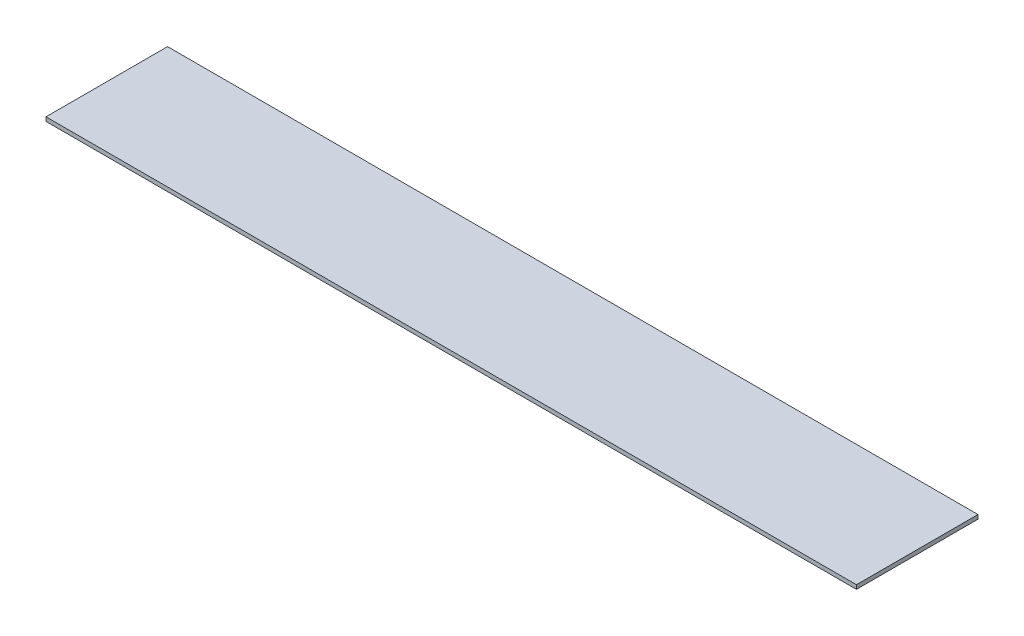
ISO-10303-21;
HEADER;
FILE_DESCRIPTION(('STEP AP214'),'2;1');
FILE_NAME('part.step','',(''),(''),'','','');
FILE_SCHEMA(('AUTOMOTIVE_DESIGN { 1 0 10303 214 1 1 1 1 }'));
ENDSEC;
DATA;
#1=APPLICATION_CONTEXT('core data for automotive mechanical design processes');
#2=APPLICATION_PROTOCOL_DEFINITION('international standard','automotive_design',2000,#1);
#3=PRODUCT_CONTEXT('',#1,'mechanical');
#4=PRODUCT('Part','Part','',(#3));
#5=PRODUCT_RELATED_PRODUCT_CATEGORY('part','',(#4));
#6=PRODUCT_DEFINITION_FORMATION('','',#4);
#7=PRODUCT_DEFINITION_CONTEXT('part definition',#1,'design');
#8=PRODUCT_DEFINITION('design','',#6,#7);
#9=PRODUCT_DEFINITION_SHAPE('','',#8);
#10=(LENGTH_UNIT() NAMED_UNIT(*) SI_UNIT(.MILLI.,.METRE.));
#11=(NAMED_UNIT(*) PLANE_ANGLE_UNIT() SI_UNIT($,.RADIAN.));
#12=(NAMED_UNIT(*) SI_UNIT($,.STERADIAN.) SOLID_ANGLE_UNIT());
#13=UNCERTAINTY_MEASURE_WITH_UNIT(LENGTH_MEASURE(1.E-05),#10,'distance_accuracy_value','');
#14=(GEOMETRIC_REPRESENTATION_CONTEXT(3) GLOBAL_UNCERTAINTY_ASSIGNED_CONTEXT((#13)) GLOBAL_UNIT_ASSIGNED_CONTEXT((#10,
#11,#12)) REPRESENTATION_CONTEXT('',''));
#15=CARTESIAN_POINT('',(0.,0.,0.));
#16=DIRECTION('',(0.,0.,1.));
#17=DIRECTION('',(1.,0.,0.));
#18=AXIS2_PLACEMENT_3D('',#15,#16,#17);
#19=CARTESIAN_POINT('',(0.,2.,0.));
#20=DIRECTION('',(1.,0.,0.));
#21=DIRECTION('',(0.,0.,-1.));
#22=AXIS2_PLACEMENT_3D('',#19,#20,#21);
#23=PLANE('',#22);
#24=DIRECTION('',(0.,0.,1.));
#25=VECTOR('',#24,1.);
#26=CARTESIAN_POINT('',(0.,0.,0.));
#27=LINE('',#26,#25);
#28=CARTESIAN_POINT('',(0.,0.,-60.));
#29=VERTEX_POINT('',#28);
#30=CARTESIAN_POINT('',(0.,0.,0.));
#31=VERTEX_POINT('',#30);
#32=EDGE_CURVE('E75',#29,#31,#27,.T.);
#33=ORIENTED_EDGE('',*,*,#32,.T.);
#34=DIRECTION('',(0.,-1.,0.));
#35=VECTOR('',#34,1.);
#36=CARTESIAN_POINT('',(0.,2.,0.));
#37=LINE('',#36,#35);
#38=CARTESIAN_POINT('',(0.,2.,0.));
#39=VERTEX_POINT('',#38);
#40=EDGE_CURVE('E11',#39,#31,#37,.T.);
#41=ORIENTED_EDGE('',*,*,#40,.F.);
#42=DIRECTION('',(0.,0.,1.));
#43=VECTOR('',#42,1.);
#44=CARTESIAN_POINT('',(0.,2.,0.));
#45=LINE('',#44,#43);
#46=CARTESIAN_POINT('',(0.,2.,-60.));
#47=VERTEX_POINT('',#46);
#48=EDGE_CURVE('E93',#47,#39,#45,.T.);
#49=ORIENTED_EDGE('',*,*,#48,.F.);
#50=DIRECTION('',(0.,-1.,0.));
#51=VECTOR('',#50,1.);
#52=CARTESIAN_POINT('',(0.,2.,-60.));
#53=LINE('',#52,#51);
#54=EDGE_CURVE('E87',#47,#29,#53,.T.);
#55=ORIENTED_EDGE('',*,*,#54,.T.);
#56=EDGE_LOOP('',(#33,#41,#49,#55));
#57=FACE_BOUND('',#56,.T.);
#58=ADVANCED_FACE('F31',(#57),#23,.F.);
#59=CARTESIAN_POINT('',(0.,2.,0.));
#60=DIRECTION('',(0.,0.,-1.));
#61=DIRECTION('',(-1.,0.,0.));
#62=AXIS2_PLACEMENT_3D('',#59,#60,#61);
#63=PLANE('',#62);
#64=DIRECTION('',(1.,0.,0.));
#65=VECTOR('',#64,1.);
#66=CARTESIAN_POINT('',(0.,0.,0.));
#67=LINE('',#66,#65);
#68=CARTESIAN_POINT('',(400.,0.,0.));
#69=VERTEX_POINT('',#68);
#70=EDGE_CURVE('E71',#31,#69,#67,.T.);
#71=ORIENTED_EDGE('',*,*,#70,.T.);
#72=DIRECTION('',(0.,-1.,0.));
#73=VECTOR('',#72,1.);
#74=CARTESIAN_POINT('',(400.,2.,0.));
#75=LINE('',#74,#73);
#76=CARTESIAN_POINT('',(400.,2.,0.));
#77=VERTEX_POINT('',#76);
#78=EDGE_CURVE('E38',#77,#69,#75,.T.);
#79=ORIENTED_EDGE('',*,*,#78,.F.);
#80=DIRECTION('',(1.,0.,0.));
#81=VECTOR('',#80,1.);
#82=CARTESIAN_POINT('',(0.,2.,0.));
#83=LINE('',#82,#81);
#84=EDGE_CURVE('E83',#39,#77,#83,.T.);
#85=ORIENTED_EDGE('',*,*,#84,.F.);
#86=ORIENTED_EDGE('',*,*,#40,.T.);
#87=EDGE_LOOP('',(#71,#79,#85,#86));
#88=FACE_BOUND('',#87,.T.);
#89=ADVANCED_FACE('F82',(#88),#63,.F.);
#90=CARTESIAN_POINT('',(400.,2.,0.));
#91=DIRECTION('',(-1.,0.,0.));
#92=DIRECTION('',(0.,0.,1.));
#93=AXIS2_PLACEMENT_3D('',#90,#91,#92);
#94=PLANE('',#93);
#95=DIRECTION('',(0.,0.,-1.));
#96=VECTOR('',#95,1.);
#97=CARTESIAN_POINT('',(400.,0.,0.));
#98=LINE('',#97,#96);
#99=CARTESIAN_POINT('',(400.,0.,-60.));
#100=VERTEX_POINT('',#99);
#101=EDGE_CURVE('E76',#69,#100,#98,.T.);
#102=ORIENTED_EDGE('',*,*,#101,.T.);
#103=DIRECTION('',(0.,-1.,0.));
#104=VECTOR('',#103,1.);
#105=CARTESIAN_POINT('',(400.,2.,-60.));
#106=LINE('',#105,#104);
#107=CARTESIAN_POINT('',(400.,2.,-60.));
#108=VERTEX_POINT('',#107);
#109=EDGE_CURVE('E99',#108,#100,#106,.T.);
#110=ORIENTED_EDGE('',*,*,#109,.F.);
#111=DIRECTION('',(0.,0.,-1.));
#112=VECTOR('',#111,1.);
#113=CARTESIAN_POINT('',(400.,2.,0.));
#114=LINE('',#113,#112);
#115=EDGE_CURVE('E50',#77,#108,#114,.T.);
#116=ORIENTED_EDGE('',*,*,#115,.F.);
#117=ORIENTED_EDGE('',*,*,#78,.T.);
#118=EDGE_LOOP('',(#102,#110,#116,#117));
#119=FACE_BOUND('',#118,.T.);
#120=ADVANCED_FACE('F102',(#119),#94,.F.);
#121=CARTESIAN_POINT('',(0.,2.,-60.));
#122=DIRECTION('',(0.,0.,1.));
#123=DIRECTION('',(1.,0.,0.));
#124=AXIS2_PLACEMENT_3D('',#121,#122,#123);
#125=PLANE('',#124);
#126=DIRECTION('',(-1.,0.,0.));
#127=VECTOR('',#126,1.);
#128=CARTESIAN_POINT('',(0.,0.,-60.));
#129=LINE('',#128,#127);
#130=EDGE_CURVE('E91',#100,#29,#129,.T.);
#131=ORIENTED_EDGE('',*,*,#130,.T.);
#132=ORIENTED_EDGE('',*,*,#54,.F.);
#133=DIRECTION('',(-1.,0.,0.));
#134=VECTOR('',#133,1.);
#135=CARTESIAN_POINT('',(0.,2.,-60.));
#136=LINE('',#135,#134);
#137=EDGE_CURVE('E45',#108,#47,#136,.T.);
#138=ORIENTED_EDGE('',*,*,#137,.F.);
#139=ORIENTED_EDGE('',*,*,#109,.T.);
#140=EDGE_LOOP('',(#131,#132,#138,#139));
#141=FACE_BOUND('',#140,.T.);
#142=ADVANCED_FACE('F104',(#141),#125,.F.);
#143=CARTESIAN_POINT('',(0.,2.,-60.));
#144=DIRECTION('',(0.,-1.,0.));
#145=DIRECTION('',(0.,0.,-1.));
#146=AXIS2_PLACEMENT_3D('',#143,#144,#145);
#147=PLANE('',#146);
#148=ORIENTED_EDGE('',*,*,#48,.T.);
#149=ORIENTED_EDGE('',*,*,#84,.T.);
#150=ORIENTED_EDGE('',*,*,#115,.T.);
#151=ORIENTED_EDGE('',*,*,#137,.T.);
#152=EDGE_LOOP('',(#148,#149,#150,#151));
#153=FACE_BOUND('',#152,.T.);
#154=ADVANCED_FACE('F105',(#153),#147,.F.);
#155=CARTESIAN_POINT('',(0.,0.,-60.));
#156=DIRECTION('',(0.,-1.,0.));
#157=DIRECTION('',(0.,0.,-1.));
#158=AXIS2_PLACEMENT_3D('',#155,#156,#157);
#159=PLANE('',#158);
#160=ORIENTED_EDGE('',*,*,#32,.F.);
#161=ORIENTED_EDGE('',*,*,#130,.F.);
#162=ORIENTED_EDGE('',*,*,#101,.F.);
#163=ORIENTED_EDGE('',*,*,#70,.F.);
#164=EDGE_LOOP('',(#160,#161,#162,#163));
#165=FACE_BOUND('',#164,.T.);
#166=ADVANCED_FACE('F72',(#165),#159,.T.);
#167=CLOSED_SHELL('',(#58,#89,#120,#142,#154,#166));
#168=MANIFOLD_SOLID_BREP('B2',#167);
#169=ADVANCED_BREP_SHAPE_REPRESENTATION('',(#18,#168),#14);
#170=SHAPE_DEFINITION_REPRESENTATION(#9,#169);
ENDSEC;
END-ISO-10303-21;
